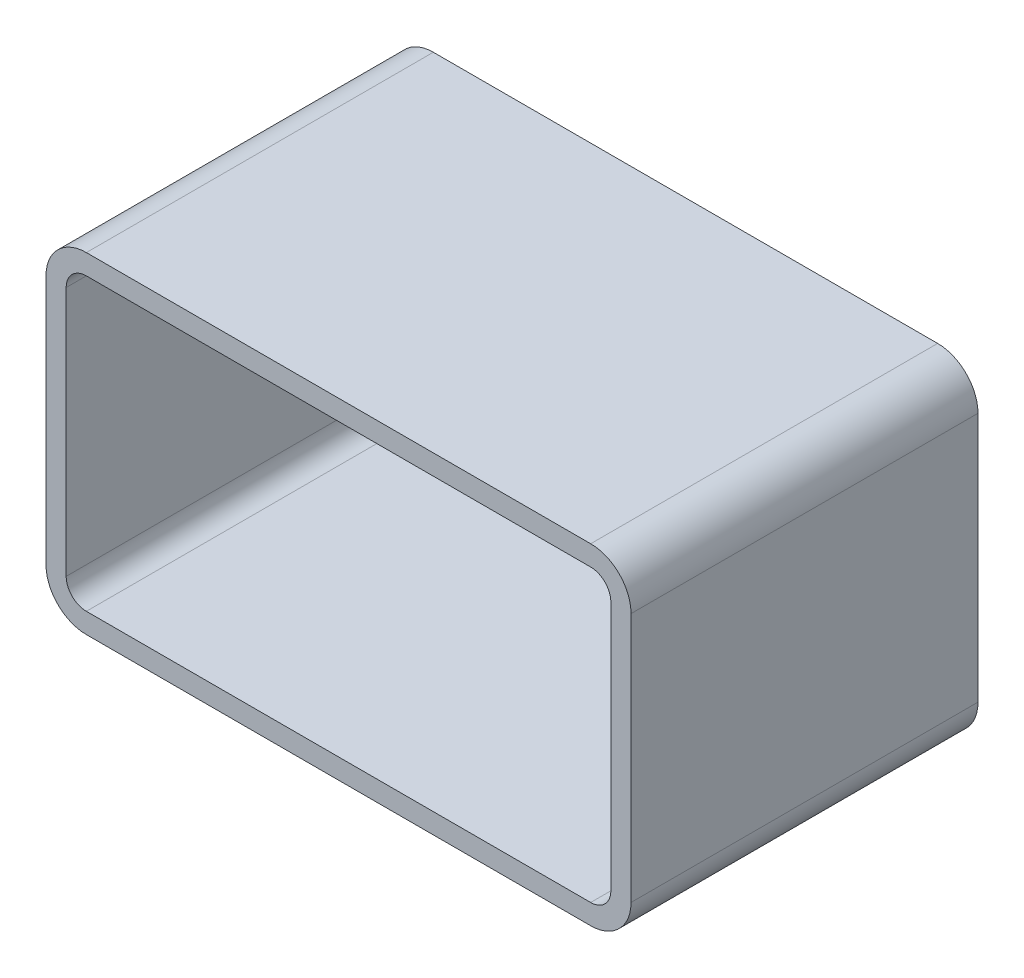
from build123d import *

# Parameters (mm, degrees)
SKETCH1_W          = 290
SKETCH1_H          = 164
BASE_EXTRUDE_DEPTH = 172
FILLET1_R          = 20
SHELL1_T           = -10


with BuildPart() as part:
    # Sketch1 → Base-Extrude (new body)
    with BuildSketch(Plane.XY):
        with Locations((145, 82)):
            Rectangle(SKETCH1_W, SKETCH1_H)
    extrude(amount=-BASE_EXTRUDE_DEPTH)

    # Fillet1
    fillet1_edges = [part.edges().sort_by_distance(p)[0] for p in [
        (0, 164, -86),
        (290, 164, -86),
        (290, 0, -86),
        (0, 0, -86),
    ]]
    fillet(fillet1_edges, radius=FILLET1_R)

    # Shell1
    shell1_openings = [part.faces().sort_by_distance(p)[0] for p in [
        (145, 82, 0),
    ]]
    offset(amount=SHELL1_T, openings=shell1_openings, kind=Kind.INTERSECTION)


solid = part.part
